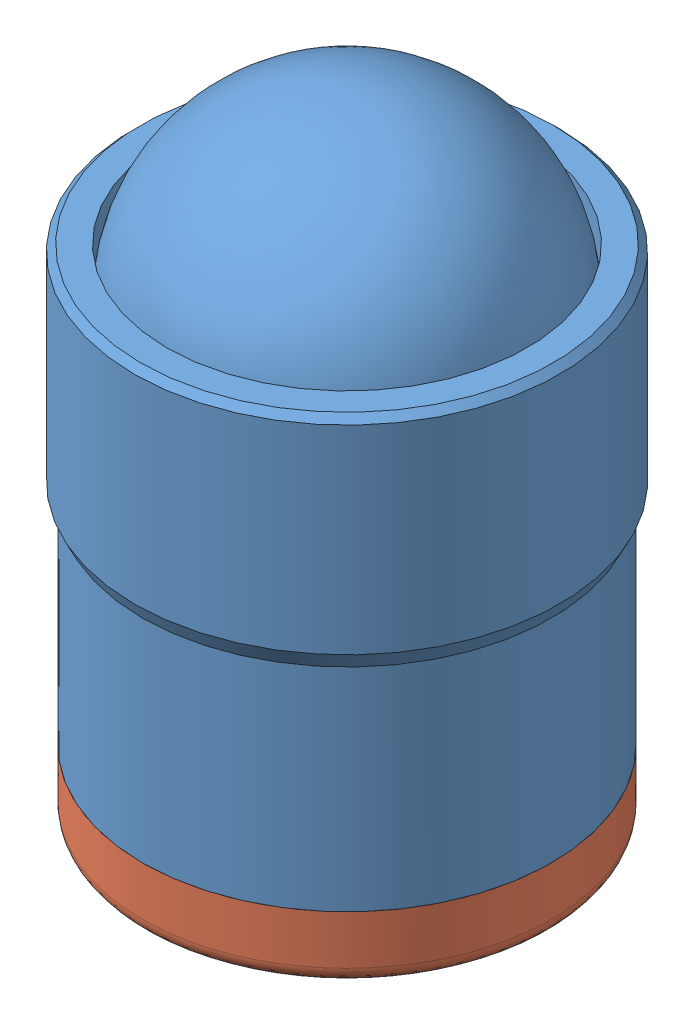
SolidWorks assembly CamAssem.SLDASM, configuration Default (file format 12000). Lengths in mm.
Overall size (217.3 245.36 217.3).
20 component instances, 12 part files, 11 mates.
Components (placement in the parent):
- InsiteTitan-1: InsiteTitan.SLDPRT [Default] at (58.3236 228.6 -56.8672) x (0 -1 0) z (0 0 1) size (219.96 165.61 165.61)
- Cam1-1: Cam1.SLDPRT [Default] at (58.3236 259.2974 -56.8672) x (-0.048934 0 0.998802) z (-0.998802 0 -0.048934) (suppressed, hidden)
- TitanCamBase-1: TitanCamBase.SLDPRT [Default] at (58.3236 53.34 -56.8672) x (0.49628 0 -0.868163) z (0 -1 0) size (159.26 159.26 43.94)
- CamInternalsAssem-1: CamInternalsAssem.SLDASM [Default] at (76.0484 39.8554 -159.7359) x (0.868163 0 0.49628) z (-0.49628 0 0.868163) size (127 62.36 127)
  - MaleBoard-1: MaleBoard.SLDPRT [Default] at (35.6636 74.4446 98.1032) size (112.89 16 119.54)
  - FemaleBoard-1: FemaleBoard.SLDPRT [Default] at (34.8601 95.6536 98.1032) x (-1 0 0) z (0 0 1) size (110.2 13.08 123.16)
  - MoutningBase-1: MoutningBase.SLDPRT [Default] at (35.6636 50.3146 98.1032) x (1 0 0) z (0 1 0) size (127 127 3.81)
  - Stand-1: Stand.SLDPRT [Default] at (62.4762 54.1246 51.6212) size (9.53 39.88 9.53)
  - Stand-2: Stand.SLDPRT [Default] at (62.4762 54.1246 144.5852) size (9.53 39.88 9.53)
  - Stand-3: Stand.SLDPRT [Default] at (-18.033 54.1246 98.1032) size (9.53 39.88 9.53)
  - Stand2-1: Stand2.SLDPRT [Default] at (-9.521 54.1246 131.0597) size (7.33 19.81 6.35)
  - Stand2-2: Stand2.SLDPRT [Default] at (69.854 54.1246 131.0597) size (7.33 19.81 6.35)
  - Stand2-3: Stand2.SLDPRT [Default] at (69.854 54.1246 65.1467) size (7.33 19.81 6.35)
  - Stand2-4: Stand2.SLDPRT [Default] at (-9.521 54.1246 65.1467) size (7.33 19.81 6.35)
  - CamStand-1: CamStand.SLDPRT [Default] at (34.8601 112.6716 98.1032) x (-1 0 0) z (0 0 1) size (120.65 27.18 120.65)
  - Stand3-1: Stand3.SLDPRT [Default] at (-18.0745 95.6536 98.1032) size (5.87 15.24 5.08)
  - Stand3-2: Stand3.SLDPRT [Default] at (62.4347 95.6536 144.5852) size (5.87 15.24 5.08)
  - Stand3-3: Stand3.SLDPRT [Default] at (62.4347 95.6536 51.6212) size (5.87 15.24 5.08)
- PandT-1: PandT.SLDPRT [Default] at (107.2205 163.957 -71.8177) x (-0.855932 0 -0.517088) z (0.517088 0 -0.855932) size (101.6 109.43 101.6)
- CamRotater-1: CamRotater.SLDPRT [Default] at (41.2085 237.8295 -30.0901) x (-0.517088 0 0.855932) z (0.188831 0.975361 0.114077) size (68.58 69.85 70.47)
Mates (geometry in assembly coordinates):
- Concentric1: concentric anti-aligned: cylinder of InsiteTitan-1 through (58.3236 228.6 -56.8672) axis (0 1 0) radius 68.834; cylinder of Cam1-1 through (58.3236 259.2974 -56.8672) axis (0 -1 0) radius 62.992
- Concentric3: concentric anti-aligned: cylinder of InsiteTitan-1 through (58.3236 228.6 -56.8672) axis (0 1 0) radius 79.629; cylinder of TitanCamBase-1 through (58.3236 53.34 -56.8672) axis (0 -1 0) radius 70.8025
- Concentric4: concentric anti-aligned: cylinder of InsiteTitan-1 through (58.3236 228.6 -56.8672) axis (0 1 0) radius 57.404; cylinder of CamInternalsAssem-1/MoutningBase-1 through (58.3236 93.98 -56.8672) axis (0 -1 0) radius 63.5
- Coincident1: coincident anti-aligned: plane of TitanCamBase-1 through (58.3236 90.17 -56.8672) normal (0 1 0); plane of CamInternalsAssem-1/MoutningBase-1 through (58.3236 90.17 -56.8672) normal (0 -1 0)
- Concentric5: concentric anti-aligned: cylinder of TitanCamBase-1 through (102.4262 83.82 -31.6562) axis (0 1 0) radius 1.5875; cylinder of CamInternalsAssem-1/MoutningBase-1 through (102.4262 93.98 -31.6562) axis (0 -1 0) radius 1.905
- Coincident2: coincident anti-aligned: plane of InsiteTitan-1 through (58.3236 78.74 -136.4962) normal (0 -1 0); plane of TitanCamBase-1 through (93.4614 78.74 -118.3353) normal (0 1 0)
- Concentric6: concentric aligned: circle of CamInternalsAssem-1/CamStand-1; circle of PandT-1
- Parallel2: parallel aligned: plane of PandT-1 through (65.6443 214.757 -7.9091) normal (0.517088 0 -0.855932); plane of CamRotater-1 through (75.3569 237.8295 -86.6159) normal (0.517088 0 -0.855932)
- Concentric7: concentric aligned: circle of PandT-1; circle of CamRotater-1
- Distance1: distance = 1.27 mm anti-aligned: plane of PandT-1 through (57.626 153.797 -57.266) normal (0 -1 0); plane of CamInternalsAssem-1/CamStand-1 through (57.626 152.527 -57.266) normal (0 1 0)
- Distance2: distance = 3.81 mm anti-aligned: plane of CamRotater-1 through (39.895 237.8295 -27.916) normal (-0.517088 0 0.855932); plane of PandT-1 through (65.6443 214.757 -7.9091) normal (0.517088 0 -0.855932)
